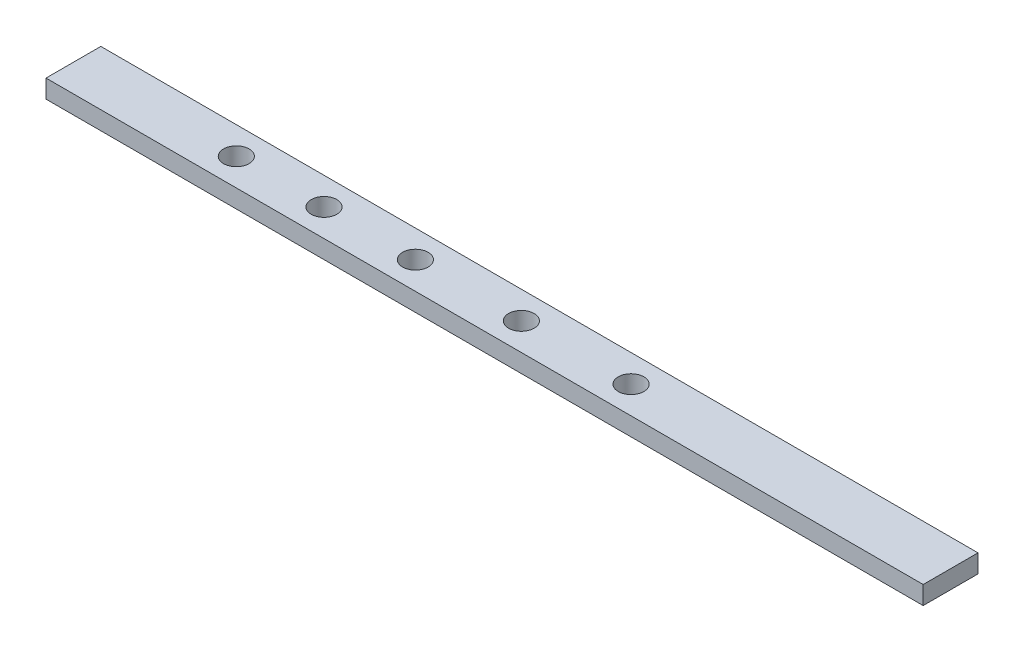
from build123d import *

# Parameters (mm, degrees)
SKETCH1_W           = 304.8
SKETCH1_H           = 19.05
BOSS_EXTRUDE1_DEPTH = 6.35
SKETCH2_R           = 4.445
CUT_EXTRUDE1_DEPTH  = 203.370394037


with BuildPart() as part:
    # Sketch1 → Boss-Extrude1 (new body)
    with BuildSketch(Plane(origin=(0, 0, 0), x_dir=(1, 0, 0), z_dir=(0, 1, 0))):
        with Locations((48.203333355, 16.393266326)):
            Rectangle(SKETCH1_W, SKETCH1_H)
    extrude(amount=BOSS_EXTRUDE1_DEPTH)

    # Sketch2 → Cut-Extrude1 (cut, through all)
    with BuildSketch(Plane.XZ):
        with Locations(Location((-47.598210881, -16.393266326, 0), (0, 0, 270))):
            Circle(SKETCH2_R)
        with Locations(Location((-17.118210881, -16.393266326, 0), (0, 0, 270))):
            Circle(SKETCH2_R)
        with Locations(Location((14.631789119, -16.393266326, 0), (0, 0, 270))):
            Circle(SKETCH2_R)
        with Locations(Location((51.461789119, -16.393266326, 0), (0, 0, 270))):
            Circle(SKETCH2_R)
        with Locations(Location((89.561789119, -16.393266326, 0), (0, 0, 270))):
            Circle(SKETCH2_R)
    extrude(amount=-CUT_EXTRUDE1_DEPTH, mode=Mode.SUBTRACT)


solid = part.part
